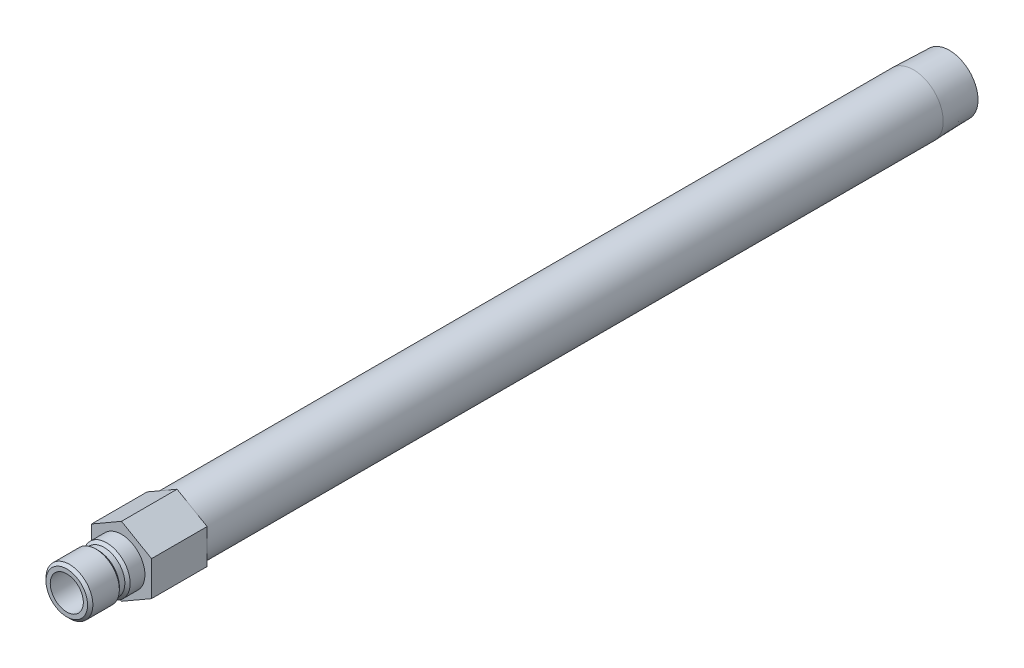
from build123d import *

# Parameters (mm, degrees)
SKETCH2_R           = 4.7625
BOSS_EXTRUDE1_DEPTH = 16.002


with BuildPart() as part:
    # Sketch1 → Revolve1 (revolve)
    with BuildSketch(Plane(origin=(0, 0, 0), x_dir=(0, 0, -1), z_dir=(1, 0, 0))):
        Polygon((-15.748, 4.7625), (-15.748, 5.9817), (-14.986, 6.7437), (-7.366, 6.7437), (-6.604, 5.9817), (-5.0165, 5.9817), (-4.2545, 6.7437), (0, 6.7437), (0, 8.5725), (227.9142, 8.5725), (238.252, 8.249445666), (238.252, 6.2611), (16.002, 6.2611), (16.002, 4.7625), align=None)
    revolve(axis=Axis((0, 0, 0), (0, 0, 1)))

    # Sketch2 → Boss-Extrude1 (add)
    with BuildSketch(Plane.XY):
        Polygon((-8.636, 4.985996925), (-8.636, -4.985996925), (0, -9.971993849), (8.636, -4.985996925), (8.636, 4.985996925), (0, 9.971993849), align=None)
        with Locations(Location((0, 0, 0), (0, 0, 90))):
            Circle(SKETCH2_R, mode=Mode.SUBTRACT)
    extrude(amount=-BOSS_EXTRUDE1_DEPTH)


solid = part.part
